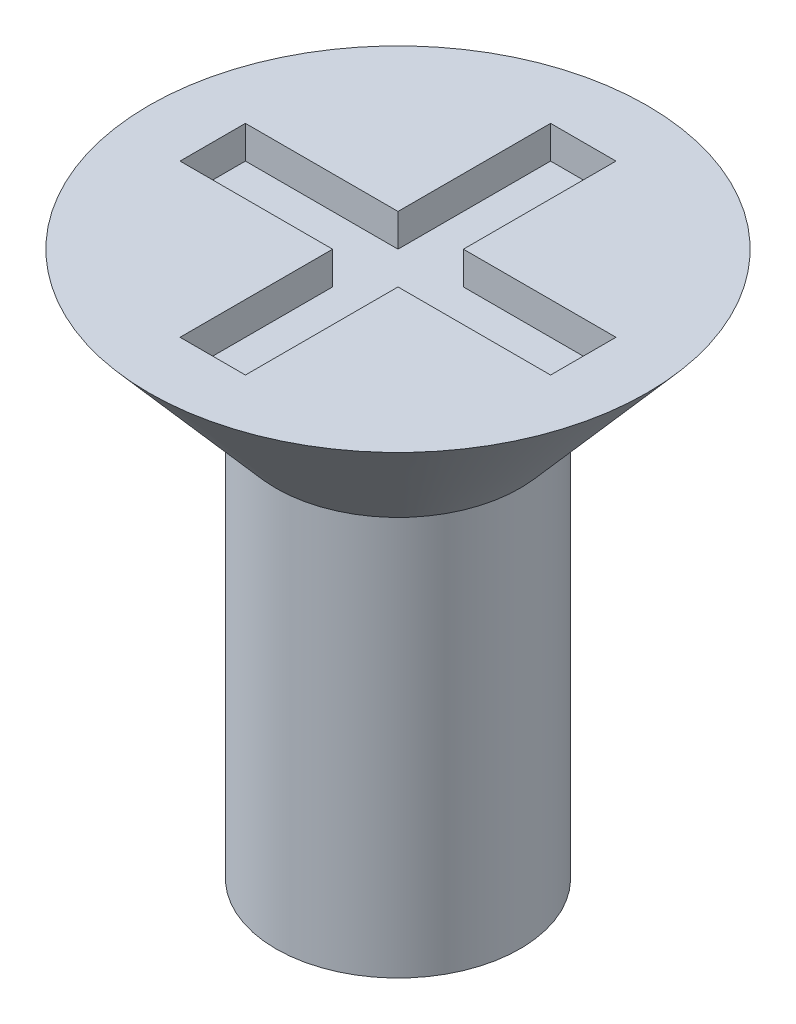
ISO-10303-21;
HEADER;
FILE_DESCRIPTION(('STEP AP214'),'2;1');
FILE_NAME('part.step','',(''),(''),'','','');
FILE_SCHEMA(('AUTOMOTIVE_DESIGN { 1 0 10303 214 1 1 1 1 }'));
ENDSEC;
DATA;
#1=APPLICATION_CONTEXT('core data for automotive mechanical design processes');
#2=APPLICATION_PROTOCOL_DEFINITION('international standard','automotive_design',2000,#1);
#3=PRODUCT_CONTEXT('',#1,'mechanical');
#4=PRODUCT('Part','Part','',(#3));
#5=PRODUCT_RELATED_PRODUCT_CATEGORY('part','',(#4));
#6=PRODUCT_DEFINITION_FORMATION('','',#4);
#7=PRODUCT_DEFINITION_CONTEXT('part definition',#1,'design');
#8=PRODUCT_DEFINITION('design','',#6,#7);
#9=PRODUCT_DEFINITION_SHAPE('','',#8);
#10=(LENGTH_UNIT() NAMED_UNIT(*) SI_UNIT(.MILLI.,.METRE.));
#11=(NAMED_UNIT(*) PLANE_ANGLE_UNIT() SI_UNIT($,.RADIAN.));
#12=(NAMED_UNIT(*) SI_UNIT($,.STERADIAN.) SOLID_ANGLE_UNIT());
#13=UNCERTAINTY_MEASURE_WITH_UNIT(LENGTH_MEASURE(1.E-05),#10,'distance_accuracy_value','');
#14=(GEOMETRIC_REPRESENTATION_CONTEXT(3) GLOBAL_UNCERTAINTY_ASSIGNED_CONTEXT((#13)) GLOBAL_UNIT_ASSIGNED_CONTEXT((#10,
#11,#12)) REPRESENTATION_CONTEXT('',''));
#15=CARTESIAN_POINT('',(0.,0.,0.));
#16=DIRECTION('',(0.,0.,1.));
#17=DIRECTION('',(1.,0.,0.));
#18=AXIS2_PLACEMENT_3D('',#15,#16,#17);
#19=CARTESIAN_POINT('',(2.90175217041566,6.35000000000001,0.));
#20=DIRECTION('',(0.,-1.,0.));
#21=DIRECTION('',(0.,0.,-0.999999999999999));
#22=AXIS2_PLACEMENT_3D('',#19,#20,#21);
#23=PLANE('',#22);
#24=CARTESIAN_POINT('',(-1.11022302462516E-13,6.34999999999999,0.));
#25=DIRECTION('',(0.,1.,0.));
#26=DIRECTION('',(0.,0.,0.999999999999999));
#27=AXIS2_PLACEMENT_3D('',#24,#25,#26);
#28=CIRCLE('',#27,2.90175217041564);
#29=CARTESIAN_POINT('',(-1.16499008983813E-13,6.34999999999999,2.90175217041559));
#30=VERTEX_POINT('',#29);
#31=EDGE_CURVE('E226',#30,#30,#28,.T.);
#32=ORIENTED_EDGE('',*,*,#31,.T.);
#33=EDGE_LOOP('',(#32));
#34=FACE_BOUND('',#33,.T.);
#35=DIRECTION('',(-1.00000000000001,0.,1.49574891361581E-09));
#36=VECTOR('',#35,1.);
#37=CARTESIAN_POINT('',(5.69433389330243E-10,6.34999999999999,0.380999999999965));
#38=LINE('',#37,#36);
#39=CARTESIAN_POINT('',(-0.38100000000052,6.34999999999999,0.381000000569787));
#40=VERTEX_POINT('',#39);
#41=CARTESIAN_POINT('',(-2.15899999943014,6.34999999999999,0.381000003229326));
#42=VERTEX_POINT('',#41);
#43=EDGE_CURVE('E182',#40,#42,#38,.T.);
#44=ORIENTED_EDGE('',*,*,#43,.T.);
#45=DIRECTION('',(1.49574563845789E-09,0.,0.999999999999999));
#46=VECTOR('',#45,1.);
#47=CARTESIAN_POINT('',(-2.1590000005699,6.34999999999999,-0.380999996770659));
#48=LINE('',#47,#46);
#49=CARTESIAN_POINT('',(-2.1590000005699,6.34999999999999,-0.380999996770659));
#50=VERTEX_POINT('',#49);
#51=EDGE_CURVE('E185',#50,#42,#48,.T.);
#52=ORIENTED_EDGE('',*,*,#51,.F.);
#53=DIRECTION('',(1.00000000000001,0.,-1.49574930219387E-09));
#54=VECTOR('',#53,1.);
#55=CARTESIAN_POINT('',(-2.1590000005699,6.34999999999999,-0.380999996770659));
#56=LINE('',#55,#54);
#57=CARTESIAN_POINT('',(-0.381000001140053,6.34999999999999,-0.380999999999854));
#58=VERTEX_POINT('',#57);
#59=EDGE_CURVE('E188',#50,#58,#56,.T.);
#60=ORIENTED_EDGE('',*,*,#59,.T.);
#61=DIRECTION('',(-2.99149255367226E-09,0.,-0.999999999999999));
#62=VECTOR('',#61,1.);
#63=CARTESIAN_POINT('',(-0.380999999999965,6.34999999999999,1.13975495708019E-09));
#64=LINE('',#63,#62);
#65=CARTESIAN_POINT('',(-0.381000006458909,6.34999999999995,-2.15899999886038));
#66=VERTEX_POINT('',#65);
#67=EDGE_CURVE('E161',#58,#66,#64,.T.);
#68=ORIENTED_EDGE('',*,*,#67,.T.);
#69=DIRECTION('',(-1.00000000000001,0.,2.99149610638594E-09));
#70=VECTOR('',#69,1.);
#71=CARTESIAN_POINT('',(0.380999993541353,6.35,-2.15900000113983));
#72=LINE('',#71,#70);
#73=CARTESIAN_POINT('',(0.380999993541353,6.35,-2.15900000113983));
#74=VERTEX_POINT('',#73);
#75=EDGE_CURVE('E164',#74,#66,#72,.T.);
#76=ORIENTED_EDGE('',*,*,#75,.F.);
#77=DIRECTION('',(2.99149260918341E-09,0.,0.999999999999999));
#78=VECTOR('',#77,1.);
#79=CARTESIAN_POINT('',(0.380999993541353,6.35,-2.15900000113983));
#80=LINE('',#79,#78);
#81=CARTESIAN_POINT('',(0.380999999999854,6.34999999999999,-0.381000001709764));
#82=VERTEX_POINT('',#81);
#83=EDGE_CURVE('E153',#74,#82,#80,.T.);
#84=ORIENTED_EDGE('',*,*,#83,.T.);
#85=DIRECTION('',(1.00000000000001,0.,-4.48724263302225E-09));
#86=VECTOR('',#85,1.);
#87=CARTESIAN_POINT('',(-1.71018754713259E-09,6.34999999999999,-0.381000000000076));
#88=LINE('',#87,#86);
#89=CARTESIAN_POINT('',(2.15899999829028,6.34999999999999,-0.381000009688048));
#90=VERTEX_POINT('',#89);
#91=EDGE_CURVE('E133',#82,#90,#88,.T.);
#92=ORIENTED_EDGE('',*,*,#91,.T.);
#93=DIRECTION('',(-4.48723913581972E-09,0.,-0.999999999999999));
#94=VECTOR('',#93,1.);
#95=CARTESIAN_POINT('',(2.15900000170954,6.35000000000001,0.380999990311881));
#96=LINE('',#95,#94);
#97=CARTESIAN_POINT('',(2.15900000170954,6.35000000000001,0.380999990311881));
#98=VERTEX_POINT('',#97);
#99=EDGE_CURVE('E144',#98,#90,#96,.T.);
#100=ORIENTED_EDGE('',*,*,#99,.F.);
#101=CARTESIAN_POINT('',(0.380999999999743,6.34999999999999,0.380999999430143));
#102=VERTEX_POINT('',#101);
#103=EDGE_CURVE('E183',#98,#102,#38,.T.);
#104=ORIENTED_EDGE('',*,*,#103,.T.);
#105=DIRECTION('',(0.,0.,0.999999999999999));
#106=VECTOR('',#105,1.);
#107=CARTESIAN_POINT('',(0.381000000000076,6.34999999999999,0.));
#108=LINE('',#107,#106);
#109=CARTESIAN_POINT('',(0.380999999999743,6.34999999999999,2.15899999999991));
#110=VERTEX_POINT('',#109);
#111=EDGE_CURVE('E209',#102,#110,#108,.T.);
#112=ORIENTED_EDGE('',*,*,#111,.T.);
#113=DIRECTION('',(1.00000000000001,0.,0.));
#114=VECTOR('',#113,1.);
#115=CARTESIAN_POINT('',(-0.381000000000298,6.35000000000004,2.15899999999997));
#116=LINE('',#115,#114);
#117=CARTESIAN_POINT('',(-0.381000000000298,6.35000000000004,2.15899999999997));
#118=VERTEX_POINT('',#117);
#119=EDGE_CURVE('E211',#118,#110,#116,.T.);
#120=ORIENTED_EDGE('',*,*,#119,.F.);
#121=DIRECTION('',(0.,0.,-0.999999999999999));
#122=VECTOR('',#121,1.);
#123=CARTESIAN_POINT('',(-0.381000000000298,6.35000000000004,2.15899999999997));
#124=LINE('',#123,#122);
#125=EDGE_CURVE('E214',#118,#40,#124,.T.);
#126=ORIENTED_EDGE('',*,*,#125,.T.);
#127=EDGE_LOOP('',(#44,#52,#60,#68,#76,#84,#92,#100,#104,#112,#120,#126));
#128=FACE_BOUND('',#127,.T.);
#129=ADVANCED_FACE('F36',(#34,#128),#23,.F.);
#130=CARTESIAN_POINT('',(0.381000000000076,5.969,0.));
#131=DIRECTION('',(-1.00000000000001,0.,0.));
#132=DIRECTION('',(0.,0.,0.999999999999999));
#133=AXIS2_PLACEMENT_3D('',#130,#131,#132);
#134=PLANE('',#133);
#135=ORIENTED_EDGE('',*,*,#111,.F.);
#136=DIRECTION('',(0.,-1.,0.));
#137=VECTOR('',#136,1.);
#138=CARTESIAN_POINT('',(0.380999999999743,5.969,0.380999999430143));
#139=LINE('',#138,#137);
#140=CARTESIAN_POINT('',(0.380999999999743,5.969,0.380999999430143));
#141=VERTEX_POINT('',#140);
#142=EDGE_CURVE('E207',#102,#141,#139,.T.);
#143=ORIENTED_EDGE('',*,*,#142,.T.);
#144=DIRECTION('',(0.,0.,0.999999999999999));
#145=VECTOR('',#144,1.);
#146=CARTESIAN_POINT('',(0.381000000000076,5.969,0.));
#147=LINE('',#146,#145);
#148=CARTESIAN_POINT('',(0.380999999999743,5.969,2.15899999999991));
#149=VERTEX_POINT('',#148);
#150=EDGE_CURVE('E59',#141,#149,#147,.T.);
#151=ORIENTED_EDGE('',*,*,#150,.T.);
#152=DIRECTION('',(0.,1.,0.));
#153=VECTOR('',#152,1.);
#154=CARTESIAN_POINT('',(0.380999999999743,5.969,2.15899999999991));
#155=LINE('',#154,#153);
#156=EDGE_CURVE('E224',#149,#110,#155,.T.);
#157=ORIENTED_EDGE('',*,*,#156,.T.);
#158=EDGE_LOOP('',(#135,#143,#151,#157));
#159=FACE_BOUND('',#158,.T.);
#160=ADVANCED_FACE('F243',(#159),#134,.T.);
#161=CARTESIAN_POINT('',(-0.381000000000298,5.96900000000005,2.15899999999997));
#162=DIRECTION('',(1.00000000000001,0.,0.));
#163=DIRECTION('',(0.,0.,-0.999999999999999));
#164=AXIS2_PLACEMENT_3D('',#161,#162,#163);
#165=PLANE('',#164);
#166=DIRECTION('',(0.,0.,-0.999999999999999));
#167=VECTOR('',#166,1.);
#168=CARTESIAN_POINT('',(-0.381000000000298,5.96900000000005,2.15899999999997));
#169=LINE('',#168,#167);
#170=CARTESIAN_POINT('',(-0.381000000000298,5.96900000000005,2.15899999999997));
#171=VERTEX_POINT('',#170);
#172=CARTESIAN_POINT('',(-0.381000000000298,5.969,0.381000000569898));
#173=VERTEX_POINT('',#172);
#174=EDGE_CURVE('E221',#171,#173,#169,.T.);
#175=ORIENTED_EDGE('',*,*,#174,.T.);
#176=DIRECTION('',(0.,1.,0.));
#177=VECTOR('',#176,1.);
#178=CARTESIAN_POINT('',(-0.381000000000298,5.969,0.381000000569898));
#179=LINE('',#178,#177);
#180=EDGE_CURVE('E204',#173,#40,#179,.T.);
#181=ORIENTED_EDGE('',*,*,#180,.T.);
#182=ORIENTED_EDGE('',*,*,#125,.F.);
#183=DIRECTION('',(0.,1.,0.));
#184=VECTOR('',#183,1.);
#185=CARTESIAN_POINT('',(-0.381000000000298,5.96900000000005,2.15899999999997));
#186=LINE('',#185,#184);
#187=EDGE_CURVE('E51',#171,#118,#186,.T.);
#188=ORIENTED_EDGE('',*,*,#187,.F.);
#189=EDGE_LOOP('',(#175,#181,#182,#188));
#190=FACE_BOUND('',#189,.T.);
#191=ADVANCED_FACE('F239',(#190),#165,.T.);
#192=CARTESIAN_POINT('',(0.,0.,0.));
#193=DIRECTION('',(0.,1.,0.));
#194=DIRECTION('',(0.,0.,0.999999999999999));
#195=AXIS2_PLACEMENT_3D('',#192,#193,#194);
#196=PLANE('',#195);
#197=CARTESIAN_POINT('',(0.,0.,0.));
#198=DIRECTION('',(0.,1.,0.));
#199=DIRECTION('',(0.,0.,0.999999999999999));
#200=AXIS2_PLACEMENT_3D('',#197,#198,#199);
#201=CIRCLE('',#200,1.42240000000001);
#202=CARTESIAN_POINT('',(0.,0.,1.42240000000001));
#203=VERTEX_POINT('',#202);
#204=EDGE_CURVE('E11',#203,#203,#201,.T.);
#205=ORIENTED_EDGE('',*,*,#204,.F.);
#206=EDGE_LOOP('',(#205));
#207=FACE_BOUND('',#206,.T.);
#208=ADVANCED_FACE('F38',(#207),#196,.F.);
#209=CARTESIAN_POINT('',(-2.22044604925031E-13,90.8693037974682,-2.22044604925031E-13));
#210=DIRECTION('',(0.,1.,0.));
#211=DIRECTION('',(0.,0.,0.999999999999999));
#212=AXIS2_PLACEMENT_3D('',#209,#210,#211);
#213=CYLINDRICAL_SURFACE('',#212,1.42240000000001);
#214=CARTESIAN_POINT('',(0.,4.64820000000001,0.));
#215=DIRECTION('',(0.,1.,0.));
#216=DIRECTION('',(0.,0.,0.999999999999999));
#217=AXIS2_PLACEMENT_3D('',#214,#215,#216);
#218=CIRCLE('',#217,1.42240000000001);
#219=CARTESIAN_POINT('',(0.,4.64820000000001,1.42240000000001));
#220=VERTEX_POINT('',#219);
#221=EDGE_CURVE('E44',#220,#220,#218,.T.);
#222=ORIENTED_EDGE('',*,*,#221,.F.);
#223=EDGE_LOOP('',(#222));
#224=FACE_BOUND('',#223,.T.);
#225=ORIENTED_EDGE('',*,*,#204,.T.);
#226=EDGE_LOOP('',(#225));
#227=FACE_BOUND('',#226,.T.);
#228=ADVANCED_FACE('F233',(#224,#227),#213,.T.);
#229=CARTESIAN_POINT('',(0.,4.64820000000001,0.));
#230=DIRECTION('',(0.,1.,0.));
#231=DIRECTION('',(0.,0.,0.999999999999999));
#232=AXIS2_PLACEMENT_3D('',#229,#230,#231);
#233=CONICAL_SURFACE('',#232,1.42240000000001,0.715584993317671);
#234=ORIENTED_EDGE('',*,*,#31,.F.);
#235=EDGE_LOOP('',(#234));
#236=FACE_BOUND('',#235,.T.);
#237=ORIENTED_EDGE('',*,*,#221,.T.);
#238=EDGE_LOOP('',(#237));
#239=FACE_BOUND('',#238,.T.);
#240=ADVANCED_FACE('F231',(#236,#239),#233,.T.);
#241=CARTESIAN_POINT('',(-0.381000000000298,5.96900000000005,2.15899999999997));
#242=DIRECTION('',(0.,0.,0.999999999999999));
#243=DIRECTION('',(1.00000000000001,0.,0.));
#244=AXIS2_PLACEMENT_3D('',#241,#242,#243);
#245=PLANE('',#244);
#246=ORIENTED_EDGE('',*,*,#119,.T.);
#247=ORIENTED_EDGE('',*,*,#156,.F.);
#248=DIRECTION('',(1.00000000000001,0.,0.));
#249=VECTOR('',#248,1.);
#250=CARTESIAN_POINT('',(-0.381000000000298,5.96900000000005,2.15899999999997));
#251=LINE('',#250,#249);
#252=EDGE_CURVE('E218',#171,#149,#251,.T.);
#253=ORIENTED_EDGE('',*,*,#252,.F.);
#254=ORIENTED_EDGE('',*,*,#187,.T.);
#255=EDGE_LOOP('',(#246,#247,#253,#254));
#256=FACE_BOUND('',#255,.T.);
#257=ADVANCED_FACE('F255',(#256),#245,.F.);
#258=CARTESIAN_POINT('',(0.381000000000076,5.969,0.));
#259=DIRECTION('',(0.,-1.,0.));
#260=DIRECTION('',(0.,0.,-0.999999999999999));
#261=AXIS2_PLACEMENT_3D('',#258,#259,#260);
#262=PLANE('',#261);
#263=ORIENTED_EDGE('',*,*,#150,.F.);
#264=DIRECTION('',(-1.00000000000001,0.,1.49574891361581E-09));
#265=VECTOR('',#264,1.);
#266=CARTESIAN_POINT('',(5.69433389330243E-10,5.969,0.380999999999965));
#267=LINE('',#266,#265);
#268=CARTESIAN_POINT('',(2.15900000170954,5.969,0.380999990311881));
#269=VERTEX_POINT('',#268);
#270=EDGE_CURVE('E192',#269,#141,#267,.T.);
#271=ORIENTED_EDGE('',*,*,#270,.F.);
#272=DIRECTION('',(-4.48723913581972E-09,0.,-0.999999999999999));
#273=VECTOR('',#272,1.);
#274=CARTESIAN_POINT('',(2.15900000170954,5.969,0.380999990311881));
#275=LINE('',#274,#273);
#276=CARTESIAN_POINT('',(2.15899999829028,5.969,-0.381000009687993));
#277=VERTEX_POINT('',#276);
#278=EDGE_CURVE('E157',#269,#277,#275,.T.);
#279=ORIENTED_EDGE('',*,*,#278,.T.);
#280=DIRECTION('',(1.00000000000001,0.,-4.48724263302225E-09));
#281=VECTOR('',#280,1.);
#282=CARTESIAN_POINT('',(-1.71018754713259E-09,5.969,-0.381000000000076));
#283=LINE('',#282,#281);
#284=CARTESIAN_POINT('',(0.380999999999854,5.969,-0.381000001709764));
#285=VERTEX_POINT('',#284);
#286=EDGE_CURVE('E135',#285,#277,#283,.T.);
#287=ORIENTED_EDGE('',*,*,#286,.F.);
#288=DIRECTION('',(2.99149260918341E-09,0.,0.999999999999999));
#289=VECTOR('',#288,1.);
#290=CARTESIAN_POINT('',(0.380999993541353,5.96900000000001,-2.15900000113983));
#291=LINE('',#290,#289);
#292=CARTESIAN_POINT('',(0.380999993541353,5.96900000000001,-2.15900000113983));
#293=VERTEX_POINT('',#292);
#294=EDGE_CURVE('E173',#293,#285,#291,.T.);
#295=ORIENTED_EDGE('',*,*,#294,.F.);
#296=DIRECTION('',(-1.00000000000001,0.,2.99149610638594E-09));
#297=VECTOR('',#296,1.);
#298=CARTESIAN_POINT('',(0.380999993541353,5.96900000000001,-2.15900000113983));
#299=LINE('',#298,#297);
#300=CARTESIAN_POINT('',(-0.381000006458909,5.96899999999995,-2.15899999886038));
#301=VERTEX_POINT('',#300);
#302=EDGE_CURVE('E170',#293,#301,#299,.T.);
#303=ORIENTED_EDGE('',*,*,#302,.T.);
#304=DIRECTION('',(-2.99149255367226E-09,0.,-0.999999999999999));
#305=VECTOR('',#304,1.);
#306=CARTESIAN_POINT('',(-0.380999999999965,5.969,1.13975495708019E-09));
#307=LINE('',#306,#305);
#308=CARTESIAN_POINT('',(-0.381000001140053,5.969,-0.380999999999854));
#309=VERTEX_POINT('',#308);
#310=EDGE_CURVE('E168',#309,#301,#307,.T.);
#311=ORIENTED_EDGE('',*,*,#310,.F.);
#312=DIRECTION('',(1.00000000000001,0.,-1.49574930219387E-09));
#313=VECTOR('',#312,1.);
#314=CARTESIAN_POINT('',(-2.1590000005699,5.969,-0.380999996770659));
#315=LINE('',#314,#313);
#316=CARTESIAN_POINT('',(-2.1590000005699,5.969,-0.380999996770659));
#317=VERTEX_POINT('',#316);
#318=EDGE_CURVE('E197',#317,#309,#315,.T.);
#319=ORIENTED_EDGE('',*,*,#318,.F.);
#320=DIRECTION('',(1.49574563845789E-09,0.,0.999999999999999));
#321=VECTOR('',#320,1.);
#322=CARTESIAN_POINT('',(-2.1590000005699,5.969,-0.380999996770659));
#323=LINE('',#322,#321);
#324=CARTESIAN_POINT('',(-2.15899999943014,5.969,0.381000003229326));
#325=VERTEX_POINT('',#324);
#326=EDGE_CURVE('E194',#317,#325,#323,.T.);
#327=ORIENTED_EDGE('',*,*,#326,.T.);
#328=EDGE_CURVE('E191',#173,#325,#267,.T.);
#329=ORIENTED_EDGE('',*,*,#328,.F.);
#330=ORIENTED_EDGE('',*,*,#174,.F.);
#331=ORIENTED_EDGE('',*,*,#252,.T.);
#332=EDGE_LOOP('',(#263,#271,#279,#287,#295,#303,#311,#319,#327,#329,#330,#331));
#333=FACE_BOUND('',#332,.T.);
#334=ADVANCED_FACE('F260',(#333),#262,.F.);
#335=CARTESIAN_POINT('',(5.69433389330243E-10,5.969,0.380999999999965));
#336=DIRECTION('',(-1.49574569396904E-09,0.,-0.999999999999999));
#337=DIRECTION('',(-1.00000000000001,0.,1.49574891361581E-09));
#338=AXIS2_PLACEMENT_3D('',#335,#336,#337);
#339=PLANE('',#338);
#340=ORIENTED_EDGE('',*,*,#103,.F.);
#341=DIRECTION('',(0.,1.,0.));
#342=VECTOR('',#341,1.);
#343=CARTESIAN_POINT('',(2.15900000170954,5.969,0.380999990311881));
#344=LINE('',#343,#342);
#345=EDGE_CURVE('E140',#269,#98,#344,.T.);
#346=ORIENTED_EDGE('',*,*,#345,.F.);
#347=ORIENTED_EDGE('',*,*,#270,.T.);
#348=ORIENTED_EDGE('',*,*,#142,.F.);
#349=EDGE_LOOP('',(#340,#346,#347,#348));
#350=FACE_BOUND('',#349,.T.);
#351=ADVANCED_FACE('F266',(#350),#339,.T.);
#352=CARTESIAN_POINT('',(-2.1590000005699,5.969,-0.380999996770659));
#353=DIRECTION('',(1.4957458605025E-09,0.,0.999999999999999));
#354=DIRECTION('',(1.00000000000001,0.,-1.49574930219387E-09));
#355=AXIS2_PLACEMENT_3D('',#352,#353,#354);
#356=PLANE('',#355);
#357=DIRECTION('',(0.,1.,0.));
#358=VECTOR('',#357,1.);
#359=CARTESIAN_POINT('',(-0.381000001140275,5.969,-0.380999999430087));
#360=LINE('',#359,#358);
#361=EDGE_CURVE('E180',#309,#58,#360,.T.);
#362=ORIENTED_EDGE('',*,*,#361,.T.);
#363=ORIENTED_EDGE('',*,*,#59,.F.);
#364=DIRECTION('',(0.,1.,0.));
#365=VECTOR('',#364,1.);
#366=CARTESIAN_POINT('',(-2.1590000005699,5.969,-0.380999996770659));
#367=LINE('',#366,#365);
#368=EDGE_CURVE('E200',#317,#50,#367,.T.);
#369=ORIENTED_EDGE('',*,*,#368,.F.);
#370=ORIENTED_EDGE('',*,*,#318,.T.);
#371=EDGE_LOOP('',(#362,#363,#369,#370));
#372=FACE_BOUND('',#371,.T.);
#373=ADVANCED_FACE('F274',(#372),#356,.T.);
#374=ORIENTED_EDGE('',*,*,#328,.T.);
#375=DIRECTION('',(0.,1.,0.));
#376=VECTOR('',#375,1.);
#377=CARTESIAN_POINT('',(-2.15899999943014,5.969,0.381000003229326));
#378=LINE('',#377,#376);
#379=EDGE_CURVE('E202',#325,#42,#378,.T.);
#380=ORIENTED_EDGE('',*,*,#379,.T.);
#381=ORIENTED_EDGE('',*,*,#43,.F.);
#382=ORIENTED_EDGE('',*,*,#180,.F.);
#383=EDGE_LOOP('',(#374,#380,#381,#382));
#384=FACE_BOUND('',#383,.T.);
#385=ADVANCED_FACE('F270',(#384),#339,.T.);
#386=CARTESIAN_POINT('',(-2.1590000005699,5.969,-0.380999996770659));
#387=DIRECTION('',(-1.00000000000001,0.,1.49574891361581E-09));
#388=DIRECTION('',(1.49574563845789E-09,0.,0.999999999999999));
#389=AXIS2_PLACEMENT_3D('',#386,#387,#388);
#390=PLANE('',#389);
#391=ORIENTED_EDGE('',*,*,#51,.T.);
#392=ORIENTED_EDGE('',*,*,#379,.F.);
#393=ORIENTED_EDGE('',*,*,#326,.F.);
#394=ORIENTED_EDGE('',*,*,#368,.T.);
#395=EDGE_LOOP('',(#391,#392,#393,#394));
#396=FACE_BOUND('',#395,.T.);
#397=ADVANCED_FACE('F273',(#396),#390,.F.);
#398=CARTESIAN_POINT('',(-0.380999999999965,5.969,1.13975495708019E-09));
#399=DIRECTION('',(1.00000000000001,0.,-2.99149593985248E-09));
#400=DIRECTION('',(-2.99149255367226E-09,0.,-0.999999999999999));
#401=AXIS2_PLACEMENT_3D('',#398,#399,#400);
#402=PLANE('',#401);
#403=ORIENTED_EDGE('',*,*,#310,.T.);
#404=DIRECTION('',(0.,1.,0.));
#405=VECTOR('',#404,1.);
#406=CARTESIAN_POINT('',(-0.381000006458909,5.96899999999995,-2.15899999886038));
#407=LINE('',#406,#405);
#408=EDGE_CURVE('E178',#301,#66,#407,.T.);
#409=ORIENTED_EDGE('',*,*,#408,.T.);
#410=ORIENTED_EDGE('',*,*,#67,.F.);
#411=ORIENTED_EDGE('',*,*,#361,.F.);
#412=EDGE_LOOP('',(#403,#409,#410,#411));
#413=FACE_BOUND('',#412,.T.);
#414=ADVANCED_FACE('F278',(#413),#402,.T.);
#415=CARTESIAN_POINT('',(0.380999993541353,5.96900000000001,-2.15900000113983));
#416=DIRECTION('',(-1.00000000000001,0.,2.99149632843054E-09));
#417=DIRECTION('',(2.99149260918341E-09,0.,0.999999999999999));
#418=AXIS2_PLACEMENT_3D('',#415,#416,#417);
#419=PLANE('',#418);
#420=DIRECTION('',(0.,1.,0.));
#421=VECTOR('',#420,1.);
#422=CARTESIAN_POINT('',(0.380999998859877,5.969,-0.381000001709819));
#423=LINE('',#422,#421);
#424=EDGE_CURVE('E139',#285,#82,#423,.T.);
#425=ORIENTED_EDGE('',*,*,#424,.T.);
#426=ORIENTED_EDGE('',*,*,#83,.F.);
#427=DIRECTION('',(0.,1.,0.));
#428=VECTOR('',#427,1.);
#429=CARTESIAN_POINT('',(0.380999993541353,5.96900000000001,-2.15900000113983));
#430=LINE('',#429,#428);
#431=EDGE_CURVE('E176',#293,#74,#430,.T.);
#432=ORIENTED_EDGE('',*,*,#431,.F.);
#433=ORIENTED_EDGE('',*,*,#294,.T.);
#434=EDGE_LOOP('',(#425,#426,#432,#433));
#435=FACE_BOUND('',#434,.T.);
#436=ADVANCED_FACE('F285',(#435),#419,.T.);
#437=CARTESIAN_POINT('',(0.380999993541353,5.96900000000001,-2.15900000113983));
#438=DIRECTION('',(-2.99149260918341E-09,0.,-0.999999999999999));
#439=DIRECTION('',(-1.00000000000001,0.,2.99149610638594E-09));
#440=AXIS2_PLACEMENT_3D('',#437,#438,#439);
#441=PLANE('',#440);
#442=ORIENTED_EDGE('',*,*,#75,.T.);
#443=ORIENTED_EDGE('',*,*,#408,.F.);
#444=ORIENTED_EDGE('',*,*,#302,.F.);
#445=ORIENTED_EDGE('',*,*,#431,.T.);
#446=EDGE_LOOP('',(#442,#443,#444,#445));
#447=FACE_BOUND('',#446,.T.);
#448=ADVANCED_FACE('F287',(#447),#441,.F.);
#449=CARTESIAN_POINT('',(-1.71018754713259E-09,5.969,-0.381000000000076));
#450=DIRECTION('',(4.48723902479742E-09,0.,0.999999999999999));
#451=DIRECTION('',(1.00000000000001,0.,-4.48724263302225E-09));
#452=AXIS2_PLACEMENT_3D('',#449,#450,#451);
#453=PLANE('',#452);
#454=ORIENTED_EDGE('',*,*,#286,.T.);
#455=DIRECTION('',(0.,1.,0.));
#456=VECTOR('',#455,1.);
#457=CARTESIAN_POINT('',(2.15899999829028,5.969,-0.381000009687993));
#458=LINE('',#457,#456);
#459=EDGE_CURVE('E128',#277,#90,#458,.T.);
#460=ORIENTED_EDGE('',*,*,#459,.T.);
#461=ORIENTED_EDGE('',*,*,#91,.F.);
#462=ORIENTED_EDGE('',*,*,#424,.F.);
#463=EDGE_LOOP('',(#454,#460,#461,#462));
#464=FACE_BOUND('',#463,.T.);
#465=ADVANCED_FACE('F130',(#464),#453,.T.);
#466=CARTESIAN_POINT('',(2.15900000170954,5.969,0.380999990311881));
#467=DIRECTION('',(1.00000000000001,0.,-4.48724263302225E-09));
#468=DIRECTION('',(-4.48723913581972E-09,0.,-0.999999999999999));
#469=AXIS2_PLACEMENT_3D('',#466,#467,#468);
#470=PLANE('',#469);
#471=ORIENTED_EDGE('',*,*,#99,.T.);
#472=ORIENTED_EDGE('',*,*,#459,.F.);
#473=ORIENTED_EDGE('',*,*,#278,.F.);
#474=ORIENTED_EDGE('',*,*,#345,.T.);
#475=EDGE_LOOP('',(#471,#472,#473,#474));
#476=FACE_BOUND('',#475,.T.);
#477=ADVANCED_FACE('F145',(#476),#470,.F.);
#478=CLOSED_SHELL('',(#129,#160,#191,#208,#228,#240,#257,#334,#351,#373,#385,#397,#414,#436,
#448,#465,#477));
#479=MANIFOLD_SOLID_BREP('B2',#478);
#480=ADVANCED_BREP_SHAPE_REPRESENTATION('',(#18,#479),#14);
#481=SHAPE_DEFINITION_REPRESENTATION(#9,#480);
ENDSEC;
END-ISO-10303-21;
